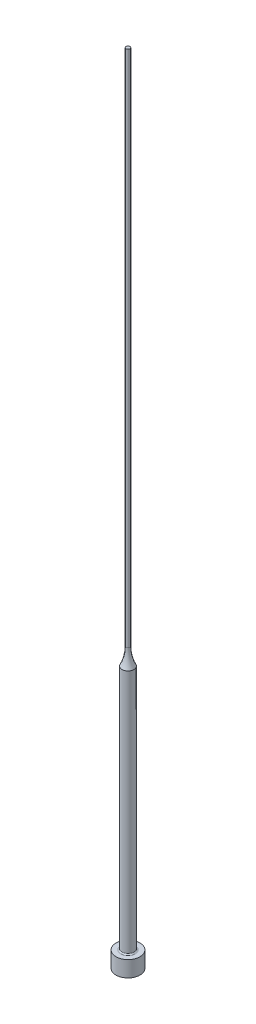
from build123d import *


with BuildPart() as part:
    # Sketch1 → Revolve1 (revolve)
    with BuildSketch(Plane.XY, mode=Mode.PRIVATE) as revolve1_sk:
        with BuildLine():
            Line((0, 0), (3, 0))
            Line((3, 0), (3, 4))
            Line((3, 4), (1.8, 4))
            ThreePointArc((1.8, 4), (1.587867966, 4.087867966), (1.5, 4.3))
            Line((1.5, 4.3), (1.5, 65.641101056))
            ThreePointArc((1.5, 65.641101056), (0.753205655, 67.763932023), (0.5, 70))
            Line((0.5, 70), (0.5, 200))
            Line((0.5, 200), (0, 200))
            Line((0, 200), (0, 0))
        make_face()
    revolve(revolve1_sk.sketch.rotate(Axis((0, 200, 0), (0, -1, 0)), 180), axis=Axis((0, 200, 0), (0, -1, 0)))


solid = part.part
